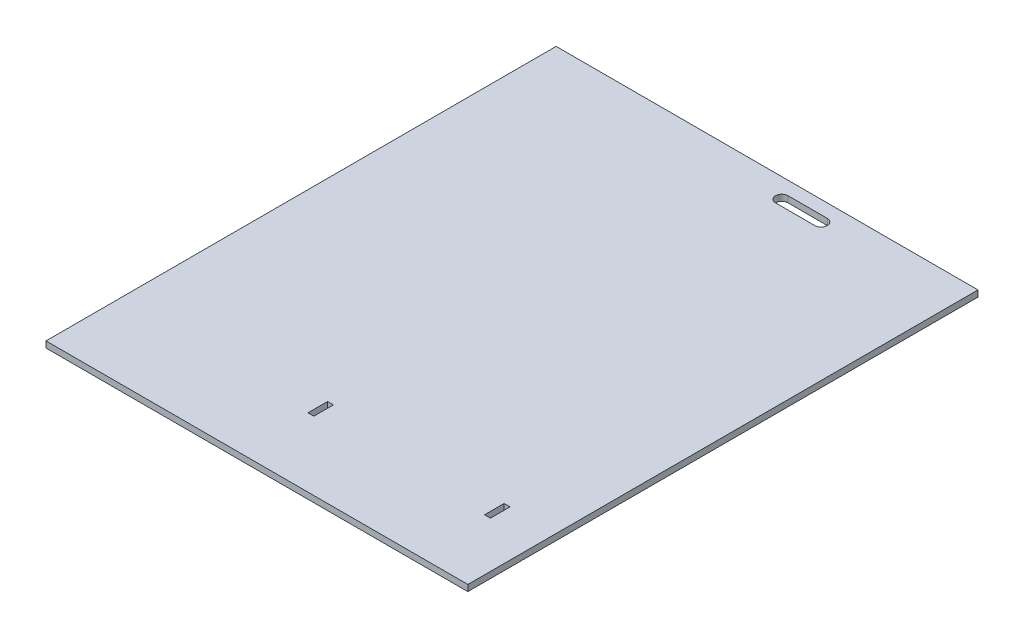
from build123d import *

# Parameters (mm, degrees)
SKETCH1_W           = 2.9972
SKETCH1_H           = 10
BOSS_EXTRUDE1_DEPTH = 3.175


with BuildPart() as part:
    # Sketch1 → Boss-Extrude1 (new body)
    with BuildSketch(Plane(origin=(0, 0, 0), x_dir=(1, 0, 0), z_dir=(0, 1, 0))):
        Polygon((-145, -98.076515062), (70, -98.076515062), (70, -50), (70, 161.923484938), (23.5, 161.923484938), (-43.5014, 161.923484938), (-145, 161.923484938), (-145, -50), align=None)
        with Locations((-45, -58.076515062)):
            Rectangle(SKETCH1_W, SKETCH1_H, mode=Mode.SUBTRACT)
        with Locations((45, -58.076515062)):
            Rectangle(SKETCH1_W, SKETCH1_H, mode=Mode.SUBTRACT)
        with BuildLine():
            Line((-20, 155.098484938), (0, 155.098484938))
            ThreePointArc((0, 155.098484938), (3.175, 151.923484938), (0, 148.748484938))
            Line((0, 148.748484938), (-20, 148.748484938))
            ThreePointArc((-20, 148.748484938), (-23.175, 151.923484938), (-20, 155.098484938))
        make_face(mode=Mode.SUBTRACT)
    extrude(amount=BOSS_EXTRUDE1_DEPTH)


solid = part.part
